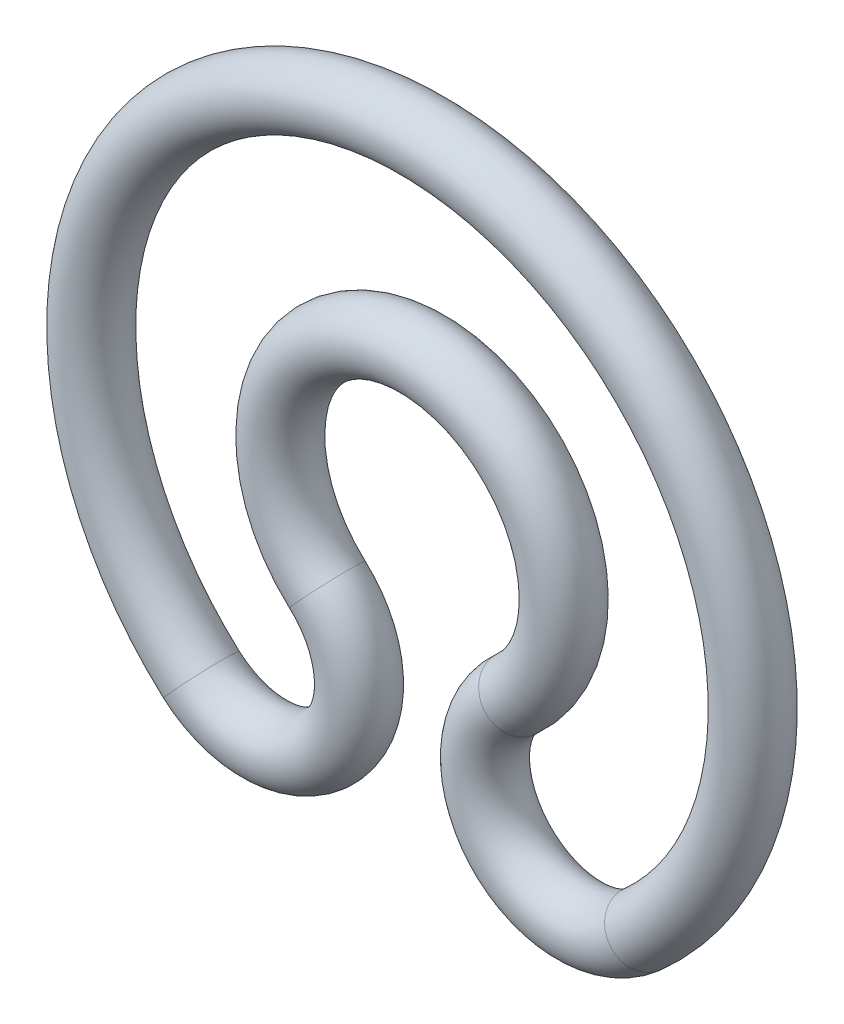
ISO-10303-21;
HEADER;
FILE_DESCRIPTION(('STEP AP214'),'2;1');
FILE_NAME('part.step','',(''),(''),'','','');
FILE_SCHEMA(('AUTOMOTIVE_DESIGN { 1 0 10303 214 1 1 1 1 }'));
ENDSEC;
DATA;
#1=APPLICATION_CONTEXT('core data for automotive mechanical design processes');
#2=APPLICATION_PROTOCOL_DEFINITION('international standard','automotive_design',2000,#1);
#3=PRODUCT_CONTEXT('',#1,'mechanical');
#4=PRODUCT('Part','Part','',(#3));
#5=PRODUCT_RELATED_PRODUCT_CATEGORY('part','',(#4));
#6=PRODUCT_DEFINITION_FORMATION('','',#4);
#7=PRODUCT_DEFINITION_CONTEXT('part definition',#1,'design');
#8=PRODUCT_DEFINITION('design','',#6,#7);
#9=PRODUCT_DEFINITION_SHAPE('','',#8);
#10=(LENGTH_UNIT() NAMED_UNIT(*) SI_UNIT(.MILLI.,.METRE.));
#11=(NAMED_UNIT(*) PLANE_ANGLE_UNIT() SI_UNIT($,.RADIAN.));
#12=(NAMED_UNIT(*) SI_UNIT($,.STERADIAN.) SOLID_ANGLE_UNIT());
#13=UNCERTAINTY_MEASURE_WITH_UNIT(LENGTH_MEASURE(1.E-05),#10,'distance_accuracy_value','');
#14=(GEOMETRIC_REPRESENTATION_CONTEXT(3) GLOBAL_UNCERTAINTY_ASSIGNED_CONTEXT((#13)) GLOBAL_UNIT_ASSIGNED_CONTEXT((#10,
#11,#12)) REPRESENTATION_CONTEXT('',''));
#15=CARTESIAN_POINT('',(0.,0.,0.));
#16=DIRECTION('',(0.,0.,1.));
#17=DIRECTION('',(1.,0.,0.));
#18=AXIS2_PLACEMENT_3D('',#15,#16,#17);
#19=CARTESIAN_POINT('',(2.5,-2.79508497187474,0.));
#20=DIRECTION('',(0.,0.,-1.));
#21=DIRECTION('',(-1.,0.,0.));
#22=AXIS2_PLACEMENT_3D('',#19,#20,#21);
#23=TOROIDAL_SURFACE('',#22,1.5,0.5);
#24=CARTESIAN_POINT('',(3.49999999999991,-3.91311896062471,0.));
#25=DIRECTION('',(-0.745355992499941,-0.666666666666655,0.));
#26=DIRECTION('',(0.,0.,1.));
#27=AXIS2_PLACEMENT_3D('',#24,#25,#26);
#28=CIRCLE('',#27,0.5);
#29=CARTESIAN_POINT('',(3.83333333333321,-4.28579695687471,0.));
#30=VERTEX_POINT('',#29);
#31=EDGE_CURVE('E32',#30,#30,#28,.T.);
#32=CARTESIAN_POINT('',(1.50000000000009,-1.67705098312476,0.));
#33=DIRECTION('',(0.745355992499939,0.666666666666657,0.));
#34=DIRECTION('',(0.,0.,1.));
#35=AXIS2_PLACEMENT_3D('',#32,#33,#34);
#36=CIRCLE('',#35,0.5);
#37=CARTESIAN_POINT('',(1.16666666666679,-1.30437298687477,0.));
#38=VERTEX_POINT('',#37);
#39=EDGE_CURVE('E10',#38,#38,#36,.T.);
#40=CARTESIAN_POINT('',(2.5,-2.79508497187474,0.));
#41=DIRECTION('',(0.,0.,-1.));
#42=DIRECTION('',(-1.,0.,0.));
#43=AXIS2_PLACEMENT_3D('',#40,#41,#42);
#44=CIRCLE('',#43,2.);
#45=EDGE_CURVE('',#30,#38,#44,.T.);
#46=ORIENTED_EDGE('',*,*,#31,.T.);
#47=ORIENTED_EDGE('',*,*,#39,.F.);
#48=ORIENTED_EDGE('',*,*,#45,.T.);
#49=ORIENTED_EDGE('',*,*,#45,.F.);
#50=EDGE_LOOP('',(#46,#48,#47,#49));
#51=FACE_BOUND('',#50,.T.);
#52=ADVANCED_FACE('F26',(#51),#23,.T.);
#53=CARTESIAN_POINT('',(0.,0.,0.));
#54=DIRECTION('',(0.,0.,-1.));
#55=DIRECTION('',(-1.,0.,0.));
#56=AXIS2_PLACEMENT_3D('',#53,#54,#55);
#57=TOROIDAL_SURFACE('',#56,5.25,0.5);
#58=CARTESIAN_POINT('',(-3.50000000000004,-3.9131189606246,0.));
#59=DIRECTION('',(-0.745355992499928,0.666666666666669,0.));
#60=DIRECTION('',(0.,0.,1.));
#61=AXIS2_PLACEMENT_3D('',#58,#59,#60);
#62=CIRCLE('',#61,0.5);
#63=CARTESIAN_POINT('',(-3.83333333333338,-4.28579695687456,0.));
#64=VERTEX_POINT('',#63);
#65=EDGE_CURVE('E36',#64,#64,#62,.T.);
#66=CARTESIAN_POINT('',(0.,0.,0.));
#67=DIRECTION('',(0.,0.,-1.));
#68=DIRECTION('',(-1.,0.,0.));
#69=AXIS2_PLACEMENT_3D('',#66,#67,#68);
#70=CIRCLE('',#69,5.75);
#71=EDGE_CURVE('',#64,#30,#70,.T.);
#72=ORIENTED_EDGE('',*,*,#65,.T.);
#73=ORIENTED_EDGE('',*,*,#31,.F.);
#74=ORIENTED_EDGE('',*,*,#71,.T.);
#75=ORIENTED_EDGE('',*,*,#71,.F.);
#76=EDGE_LOOP('',(#72,#74,#73,#75));
#77=FACE_BOUND('',#76,.T.);
#78=ADVANCED_FACE('F55',(#77),#57,.T.);
#79=CARTESIAN_POINT('',(-2.5,-2.79508497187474,0.));
#80=DIRECTION('',(0.,0.,-1.));
#81=DIRECTION('',(-1.,0.,0.));
#82=AXIS2_PLACEMENT_3D('',#79,#80,#81);
#83=TOROIDAL_SURFACE('',#82,1.5,0.5);
#84=CARTESIAN_POINT('',(-1.49999999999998,-1.67705098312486,0.));
#85=DIRECTION('',(0.745355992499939,-0.666666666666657,0.));
#86=DIRECTION('',(0.,0.,1.));
#87=AXIS2_PLACEMENT_3D('',#84,#85,#86);
#88=CIRCLE('',#87,0.5);
#89=CARTESIAN_POINT('',(-1.16666666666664,-1.3043729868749,0.));
#90=VERTEX_POINT('',#89);
#91=EDGE_CURVE('E40',#90,#90,#88,.T.);
#92=CARTESIAN_POINT('',(-2.5,-2.79508497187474,0.));
#93=DIRECTION('',(0.,0.,-1.));
#94=DIRECTION('',(-1.,0.,0.));
#95=AXIS2_PLACEMENT_3D('',#92,#93,#94);
#96=CIRCLE('',#95,2.);
#97=EDGE_CURVE('',#90,#64,#96,.T.);
#98=ORIENTED_EDGE('',*,*,#91,.T.);
#99=ORIENTED_EDGE('',*,*,#65,.F.);
#100=ORIENTED_EDGE('',*,*,#97,.T.);
#101=ORIENTED_EDGE('',*,*,#97,.F.);
#102=EDGE_LOOP('',(#98,#100,#99,#101));
#103=FACE_BOUND('',#102,.T.);
#104=ADVANCED_FACE('F46',(#103),#83,.T.);
#105=CARTESIAN_POINT('',(0.,0.,0.));
#106=DIRECTION('',(0.,0.,-1.));
#107=DIRECTION('',(-1.,0.,0.));
#108=AXIS2_PLACEMENT_3D('',#105,#106,#107);
#109=TOROIDAL_SURFACE('',#108,2.25,0.5);
#110=ORIENTED_EDGE('',*,*,#91,.F.);
#111=EDGE_LOOP('',(#110));
#112=FACE_BOUND('',#111,.T.);
#113=ORIENTED_EDGE('',*,*,#39,.T.);
#114=EDGE_LOOP('',(#113));
#115=FACE_BOUND('',#114,.T.);
#116=ADVANCED_FACE('F49',(#112,#115),#109,.T.);
#117=CLOSED_SHELL('',(#52,#78,#104,#116));
#118=MANIFOLD_SOLID_BREP('B2',#117);
#119=ADVANCED_BREP_SHAPE_REPRESENTATION('',(#18,#118),#14);
#120=SHAPE_DEFINITION_REPRESENTATION(#9,#119);
ENDSEC;
END-ISO-10303-21;
